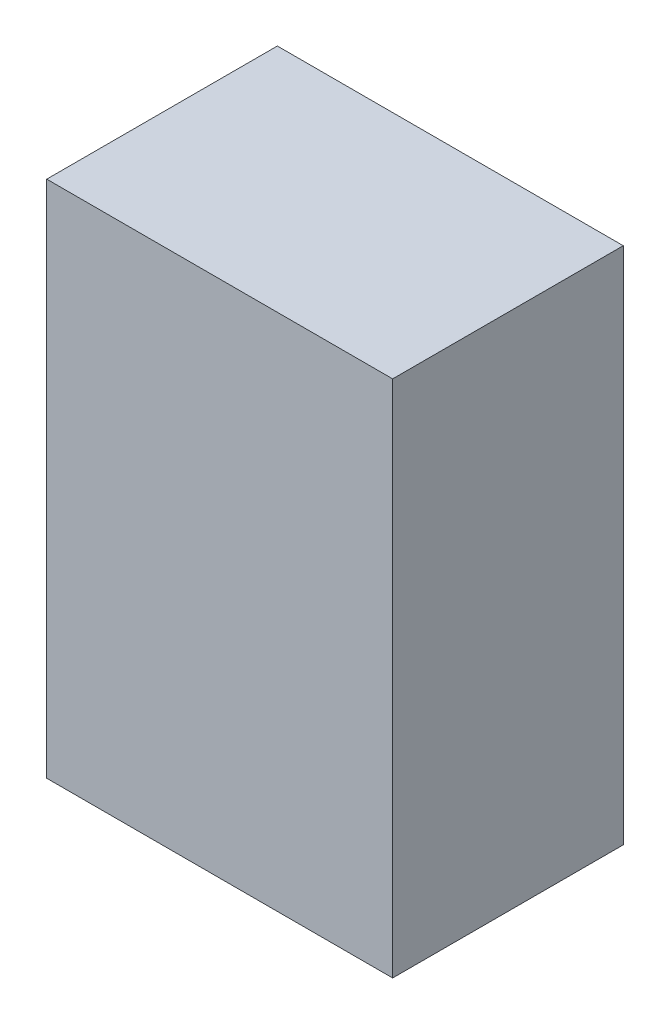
from build123d import *

# Parameters (mm, degrees)
SKETCH1_W           = 76.2
SKETCH1_H           = 114.3
BOSS_EXTRUDE1_DEPTH = 50.8


with BuildPart() as part:
    # Sketch1 → Boss-Extrude1 (new body)
    with BuildSketch(Plane.XY):
        Rectangle(SKETCH1_W, SKETCH1_H)
    extrude(amount=BOSS_EXTRUDE1_DEPTH)


solid = part.part
